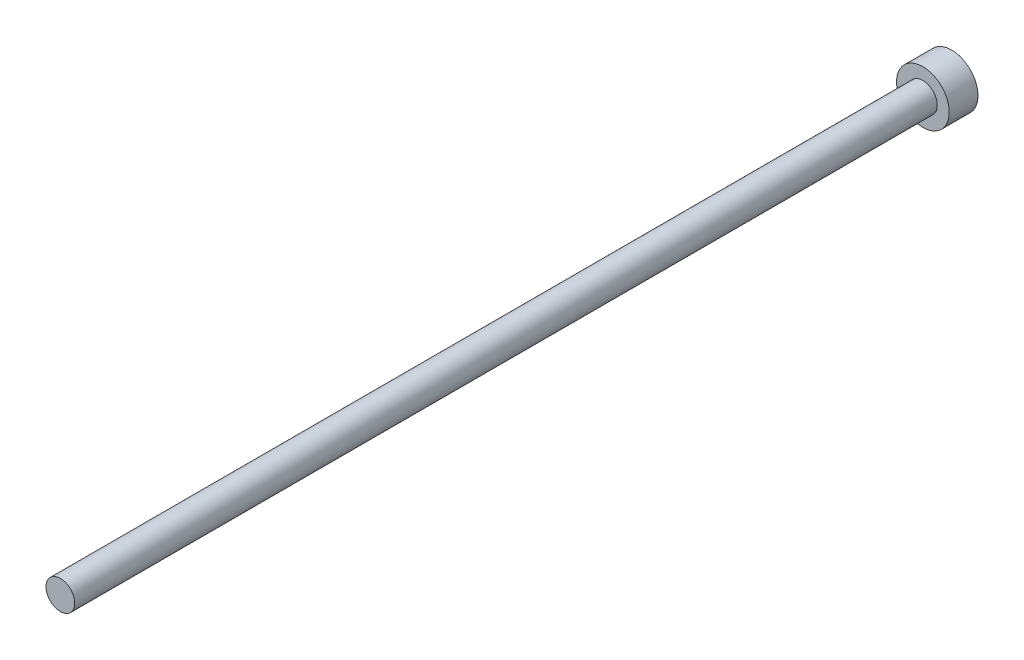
ISO-10303-21;
HEADER;
FILE_DESCRIPTION(('STEP AP214'),'2;1');
FILE_NAME('part.step','',(''),(''),'','','');
FILE_SCHEMA(('AUTOMOTIVE_DESIGN { 1 0 10303 214 1 1 1 1 }'));
ENDSEC;
DATA;
#1=APPLICATION_CONTEXT('core data for automotive mechanical design processes');
#2=APPLICATION_PROTOCOL_DEFINITION('international standard','automotive_design',2000,#1);
#3=PRODUCT_CONTEXT('',#1,'mechanical');
#4=PRODUCT('Part','Part','',(#3));
#5=PRODUCT_RELATED_PRODUCT_CATEGORY('part','',(#4));
#6=PRODUCT_DEFINITION_FORMATION('','',#4);
#7=PRODUCT_DEFINITION_CONTEXT('part definition',#1,'design');
#8=PRODUCT_DEFINITION('design','',#6,#7);
#9=PRODUCT_DEFINITION_SHAPE('','',#8);
#10=(LENGTH_UNIT() NAMED_UNIT(*) SI_UNIT(.MILLI.,.METRE.));
#11=(NAMED_UNIT(*) PLANE_ANGLE_UNIT() SI_UNIT($,.RADIAN.));
#12=(NAMED_UNIT(*) SI_UNIT($,.STERADIAN.) SOLID_ANGLE_UNIT());
#13=UNCERTAINTY_MEASURE_WITH_UNIT(LENGTH_MEASURE(1.E-05),#10,'distance_accuracy_value','');
#14=(GEOMETRIC_REPRESENTATION_CONTEXT(3) GLOBAL_UNCERTAINTY_ASSIGNED_CONTEXT((#13)) GLOBAL_UNIT_ASSIGNED_CONTEXT((#10,
#11,#12)) REPRESENTATION_CONTEXT('',''));
#15=CARTESIAN_POINT('',(0.,0.,0.));
#16=DIRECTION('',(0.,0.,1.));
#17=DIRECTION('',(1.,0.,0.));
#18=AXIS2_PLACEMENT_3D('',#15,#16,#17);
#19=CARTESIAN_POINT('',(0.,0.,0.));
#20=DIRECTION('',(0.,0.,-1.));
#21=DIRECTION('',(-1.,0.,0.));
#22=AXIS2_PLACEMENT_3D('',#19,#20,#21);
#23=CYLINDRICAL_SURFACE('',#22,2.75);
#24=CARTESIAN_POINT('',(0.,0.,0.));
#25=DIRECTION('',(0.,0.,1.));
#26=DIRECTION('',(1.,0.,0.));
#27=AXIS2_PLACEMENT_3D('',#24,#25,#26);
#28=CIRCLE('',#27,2.75);
#29=CARTESIAN_POINT('',(2.75,0.,0.));
#30=VERTEX_POINT('',#29);
#31=EDGE_CURVE('E48',#30,#30,#28,.T.);
#32=ORIENTED_EDGE('',*,*,#31,.F.);
#33=EDGE_LOOP('',(#32));
#34=FACE_BOUND('',#33,.T.);
#35=CARTESIAN_POINT('',(0.,0.,-3.));
#36=DIRECTION('',(0.,0.,1.));
#37=DIRECTION('',(1.,0.,0.));
#38=AXIS2_PLACEMENT_3D('',#35,#36,#37);
#39=CIRCLE('',#38,2.75);
#40=CARTESIAN_POINT('',(2.75,0.,-3.));
#41=VERTEX_POINT('',#40);
#42=EDGE_CURVE('E44',#41,#41,#39,.T.);
#43=ORIENTED_EDGE('',*,*,#42,.T.);
#44=EDGE_LOOP('',(#43));
#45=FACE_BOUND('',#44,.T.);
#46=ADVANCED_FACE('F41',(#34,#45),#23,.T.);
#47=CARTESIAN_POINT('',(0.,0.,0.));
#48=DIRECTION('',(0.,0.,1.));
#49=DIRECTION('',(1.,0.,0.));
#50=AXIS2_PLACEMENT_3D('',#47,#48,#49);
#51=PLANE('',#50);
#52=CARTESIAN_POINT('',(0.,0.,0.));
#53=DIRECTION('',(0.,0.,1.));
#54=DIRECTION('',(1.,0.,0.));
#55=AXIS2_PLACEMENT_3D('',#52,#53,#54);
#56=CIRCLE('',#55,1.5);
#57=CARTESIAN_POINT('',(-1.5,0.,0.));
#58=VERTEX_POINT('',#57);
#59=EDGE_CURVE('E10',#58,#58,#56,.T.);
#60=ORIENTED_EDGE('',*,*,#59,.F.);
#61=EDGE_LOOP('',(#60));
#62=FACE_BOUND('',#61,.T.);
#63=ORIENTED_EDGE('',*,*,#31,.T.);
#64=EDGE_LOOP('',(#63));
#65=FACE_BOUND('',#64,.T.);
#66=ADVANCED_FACE('F65',(#62,#65),#51,.T.);
#67=CARTESIAN_POINT('',(0.,0.,-3.));
#68=DIRECTION('',(0.,0.,1.));
#69=DIRECTION('',(1.,0.,0.));
#70=AXIS2_PLACEMENT_3D('',#67,#68,#69);
#71=PLANE('',#70);
#72=ORIENTED_EDGE('',*,*,#42,.F.);
#73=EDGE_LOOP('',(#72));
#74=FACE_BOUND('',#73,.T.);
#75=ADVANCED_FACE('F62',(#74),#71,.F.);
#76=CARTESIAN_POINT('',(0.,0.,90.));
#77=DIRECTION('',(0.,0.,-1.));
#78=DIRECTION('',(-1.,0.,0.));
#79=AXIS2_PLACEMENT_3D('',#76,#77,#78);
#80=CYLINDRICAL_SURFACE('',#79,1.5);
#81=CARTESIAN_POINT('',(0.,0.,90.));
#82=DIRECTION('',(0.,0.,1.));
#83=DIRECTION('',(1.,0.,0.));
#84=AXIS2_PLACEMENT_3D('',#81,#82,#83);
#85=CIRCLE('',#84,1.5);
#86=CARTESIAN_POINT('',(-1.5,0.,90.));
#87=VERTEX_POINT('',#86);
#88=EDGE_CURVE('E54',#87,#87,#85,.T.);
#89=CARTESIAN_POINT('',(-1.5,0.,90.));
#90=CARTESIAN_POINT('',(-1.5,0.,89.0625));
#91=CARTESIAN_POINT('',(-1.5,0.,88.125));
#92=CARTESIAN_POINT('',(-1.5,0.,86.25));
#93=CARTESIAN_POINT('',(-1.5,0.,85.3125));
#94=CARTESIAN_POINT('',(-1.5,0.,83.4375));
#95=CARTESIAN_POINT('',(-1.5,0.,82.5));
#96=CARTESIAN_POINT('',(-1.5,0.,80.625));
#97=CARTESIAN_POINT('',(-1.5,0.,79.6875));
#98=CARTESIAN_POINT('',(-1.5,0.,77.8125));
#99=CARTESIAN_POINT('',(-1.5,0.,76.875));
#100=CARTESIAN_POINT('',(-1.5,0.,75.));
#101=CARTESIAN_POINT('',(-1.5,0.,74.0625));
#102=CARTESIAN_POINT('',(-1.5,0.,72.1875));
#103=CARTESIAN_POINT('',(-1.5,0.,71.25));
#104=CARTESIAN_POINT('',(-1.5,0.,69.375));
#105=CARTESIAN_POINT('',(-1.5,0.,68.4375));
#106=CARTESIAN_POINT('',(-1.5,0.,66.5625));
#107=CARTESIAN_POINT('',(-1.5,0.,65.625));
#108=CARTESIAN_POINT('',(-1.5,0.,63.75));
#109=CARTESIAN_POINT('',(-1.5,0.,62.8125));
#110=CARTESIAN_POINT('',(-1.5,0.,60.9375));
#111=CARTESIAN_POINT('',(-1.5,0.,60.));
#112=CARTESIAN_POINT('',(-1.5,0.,58.125));
#113=CARTESIAN_POINT('',(-1.5,0.,57.1875));
#114=CARTESIAN_POINT('',(-1.5,0.,55.3125));
#115=CARTESIAN_POINT('',(-1.5,0.,54.375));
#116=CARTESIAN_POINT('',(-1.5,0.,52.5));
#117=CARTESIAN_POINT('',(-1.5,0.,51.5625));
#118=CARTESIAN_POINT('',(-1.5,0.,49.6875));
#119=CARTESIAN_POINT('',(-1.5,0.,48.75));
#120=CARTESIAN_POINT('',(-1.5,0.,46.875));
#121=CARTESIAN_POINT('',(-1.5,0.,45.9375));
#122=CARTESIAN_POINT('',(-1.5,0.,44.0625));
#123=CARTESIAN_POINT('',(-1.5,0.,43.125));
#124=CARTESIAN_POINT('',(-1.5,0.,41.25));
#125=CARTESIAN_POINT('',(-1.5,0.,40.3125));
#126=CARTESIAN_POINT('',(-1.5,0.,38.4375));
#127=CARTESIAN_POINT('',(-1.5,0.,37.5));
#128=CARTESIAN_POINT('',(-1.5,0.,35.625));
#129=CARTESIAN_POINT('',(-1.5,0.,34.6875));
#130=CARTESIAN_POINT('',(-1.5,0.,32.8125));
#131=CARTESIAN_POINT('',(-1.5,0.,31.875));
#132=CARTESIAN_POINT('',(-1.5,0.,30.));
#133=CARTESIAN_POINT('',(-1.5,0.,29.0625));
#134=CARTESIAN_POINT('',(-1.5,0.,27.1875));
#135=CARTESIAN_POINT('',(-1.5,0.,26.25));
#136=CARTESIAN_POINT('',(-1.5,0.,24.375));
#137=CARTESIAN_POINT('',(-1.5,0.,23.4375));
#138=CARTESIAN_POINT('',(-1.5,0.,21.5625));
#139=CARTESIAN_POINT('',(-1.5,0.,20.625));
#140=CARTESIAN_POINT('',(-1.5,0.,18.75));
#141=CARTESIAN_POINT('',(-1.5,0.,17.8125));
#142=CARTESIAN_POINT('',(-1.5,0.,15.9375));
#143=CARTESIAN_POINT('',(-1.5,0.,15.));
#144=CARTESIAN_POINT('',(-1.5,0.,13.125));
#145=CARTESIAN_POINT('',(-1.5,0.,12.1875));
#146=CARTESIAN_POINT('',(-1.5,0.,10.3125));
#147=CARTESIAN_POINT('',(-1.5,0.,9.37499999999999));
#148=CARTESIAN_POINT('',(-1.5,0.,7.49999999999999));
#149=CARTESIAN_POINT('',(-1.5,0.,6.56249999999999));
#150=CARTESIAN_POINT('',(-1.5,0.,4.68749999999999));
#151=CARTESIAN_POINT('',(-1.5,0.,3.74999999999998));
#152=CARTESIAN_POINT('',(-1.5,0.,1.87499999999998));
#153=CARTESIAN_POINT('',(-1.5,0.,0.937499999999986));
#154=CARTESIAN_POINT('',(-1.5,0.,0.));
#155=B_SPLINE_CURVE_WITH_KNOTS('',3,(#89,#90,#91,#92,#93,#94,#95,#96,#97,#98,#99,#100,#101,#102,
#103,#104,#105,#106,#107,#108,#109,#110,#111,#112,#113,#114,#115,#116,#117,#118,#119,#120,#121,
#122,#123,#124,#125,#126,#127,#128,#129,#130,#131,#132,#133,#134,#135,#136,#137,#138,#139,#140,
#141,#142,#143,#144,#145,#146,#147,#148,#149,#150,#151,#152,#153,#154),.UNSPECIFIED.,.F.,.F.,(4,
2,2,2,2,2,2,2,2,2,2,2,2,2,2,2,2,2,2,2,2,2,2,2,2,2,2,2,2,2,2,2,4),(0.,2.81250000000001,
5.62500000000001,8.43750000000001,11.25,14.0625,16.875,19.6875,22.5,25.3125,28.125,30.9375,
33.75,36.5625,39.375,42.1875,45.,47.8125,50.625,53.4375,56.25,59.0625,61.875,64.6875,67.5,
70.3125,73.125,75.9375,78.75,81.5625,84.375,87.1875,90.),.UNSPECIFIED.);
#156=EDGE_CURVE('BSEAM64',#87,#58,#155,.T.);
#157=ORIENTED_EDGE('',*,*,#88,.F.);
#158=ORIENTED_EDGE('',*,*,#59,.T.);
#159=ORIENTED_EDGE('',*,*,#156,.T.);
#160=ORIENTED_EDGE('',*,*,#156,.F.);
#161=EDGE_LOOP('',(#157,#159,#158,#160));
#162=FACE_BOUND('',#161,.T.);
#163=ADVANCED_FACE('F64',(#162),#80,.T.);
#164=CARTESIAN_POINT('',(0.,0.,90.));
#165=DIRECTION('',(0.,0.,1.));
#166=DIRECTION('',(1.,0.,0.));
#167=AXIS2_PLACEMENT_3D('',#164,#165,#166);
#168=PLANE('',#167);
#169=ORIENTED_EDGE('',*,*,#88,.T.);
#170=EDGE_LOOP('',(#169));
#171=FACE_BOUND('',#170,.T.);
#172=ADVANCED_FACE('F71',(#171),#168,.T.);
#173=CLOSED_SHELL('',(#46,#66,#75,#163,#172));
#174=MANIFOLD_SOLID_BREP('B2',#173);
#175=ADVANCED_BREP_SHAPE_REPRESENTATION('',(#18,#174),#14);
#176=SHAPE_DEFINITION_REPRESENTATION(#9,#175);
ENDSEC;
END-ISO-10303-21;
